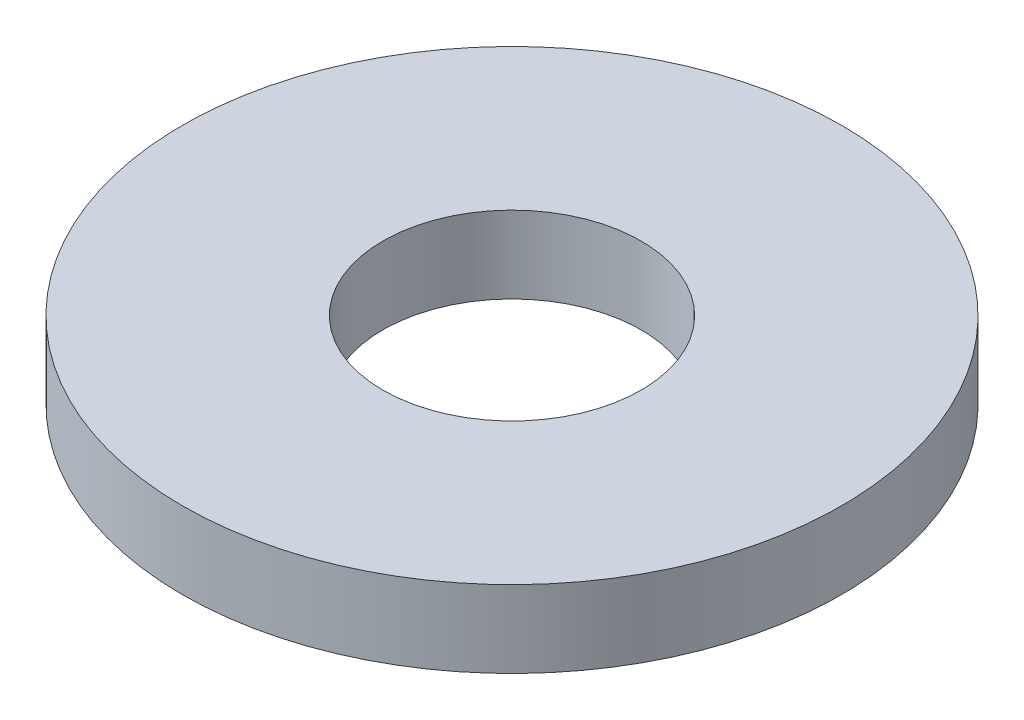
from build123d import *

# Parameters (mm, degrees)
SKETCH1_R           = 5.9944
SKETCH1_R_2         = 2.3495
BOSS_EXTRUDE1_DEPTH = 1.4


with BuildPart() as part:
    # Sketch1 → Boss-Extrude1 (new body)
    with BuildSketch(Plane(origin=(0, 0, 0), x_dir=(1, 0, 0), z_dir=(0, 1, 0))):
        with Locations(Location((0, 0, 0), (0, 0, 270))):
            Circle(SKETCH1_R)
        with Locations(Location((0, 0, 0), (0, 0, 270))):
            Circle(SKETCH1_R_2, mode=Mode.SUBTRACT)
    extrude(amount=BOSS_EXTRUDE1_DEPTH)


solid = part.part
